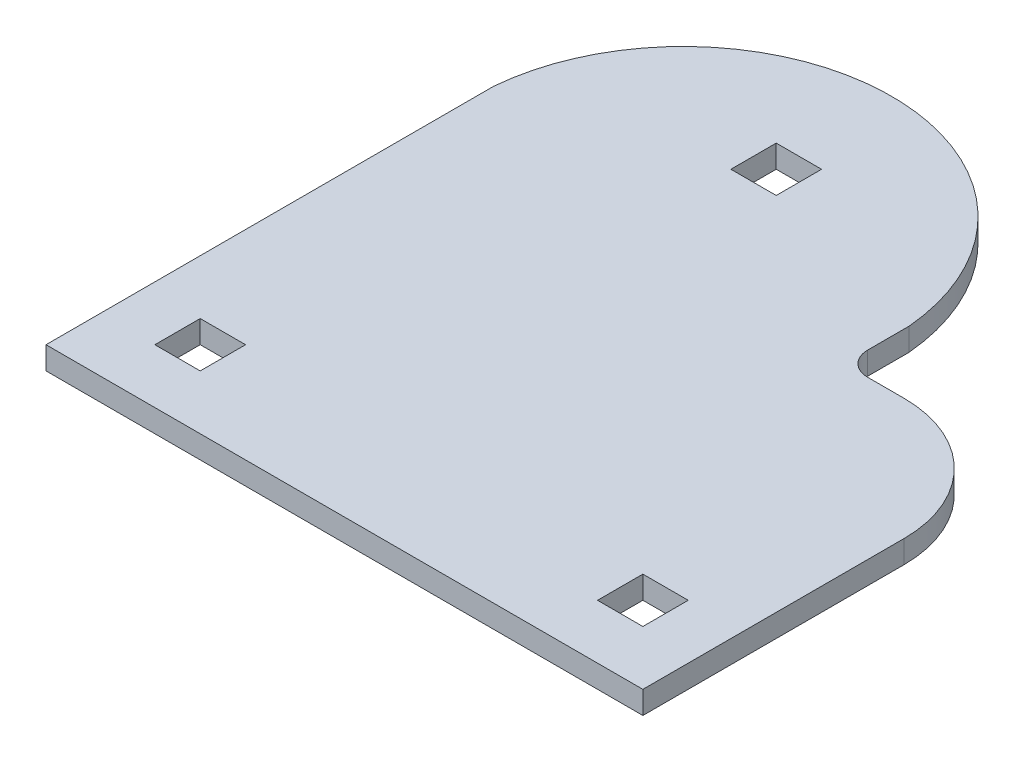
from build123d import *

# Parameters (mm, degrees)
SKETCH2_W               = 83.566
SKETCH2_H               = 6.329180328
SKETCH2_H_2             = 1.778
LID_DEPTH               = 3.175
CUT_EXTRUDE1_DEPTH      = 90.869382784
CUT_EXTRUDE1_DEPTH_BACK = 90.869382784
SKETCH3_W               = 6.35
SKETCH3_H               = 6.35


with BuildPart() as part:
    # Sketch2 → lid (new body)
    with BuildSketch(Plane(origin=(0, 0, 0), x_dir=(1, 0, 0), z_dir=(0, 1, 0))):
        with Locations((-34.925, -41.772590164)):
            Rectangle(SKETCH2_W, SKETCH2_H)
        with Locations((-34.925, -45.826180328)):
            Rectangle(SKETCH2_W, SKETCH2_H_2)
        with BuildLine():
            Line((-76.708, 0), (-76.708, 15.953751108))
            ThreePointArc((-76.708, 15.953751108), (-47.625, 42.606368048), (-18.542, 15.953751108))
            Line((-18.542, 15.953751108), (-18.542, 10.16))
            ThreePointArc((-18.542, 10.16), (-17.574866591, 7.825133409), (-15.24, 6.858))
            Line((-15.24, 6.858), (-10.16, 6.858))
            ThreePointArc((-10.16, 6.858), (1.873543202, 1.873543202), (6.858, -10.16))
            Line((6.858, -10.16), (6.858, -38.608))
            Line((6.858, -38.608), (-76.708, -38.608))
            Line((-76.708, -38.608), (-76.708, 0))
        make_face()
    extrude(amount=LID_DEPTH)

    # Sketch3 → Cut-Extrude1 (cut, two sides: drawn at the far end of the back side and taken through both)
    with BuildSketch(Plane(origin=(0, 3.175, 0), x_dir=(1, 0, 0), z_dir=(0, 1, 0)).offset(-CUT_EXTRUDE1_DEPTH_BACK)):
        with Locations((-65.913, -35.920180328)):
            Rectangle(SKETCH3_W, SKETCH3_H)
        with Locations((-3.937, -35.920180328)):
            Rectangle(SKETCH3_W, SKETCH3_H)
        with Locations((-46.863, 25.674819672)):
            Rectangle(SKETCH3_W, SKETCH3_H)
    extrude(amount=CUT_EXTRUDE1_DEPTH + CUT_EXTRUDE1_DEPTH_BACK, mode=Mode.SUBTRACT)


solid = part.part
